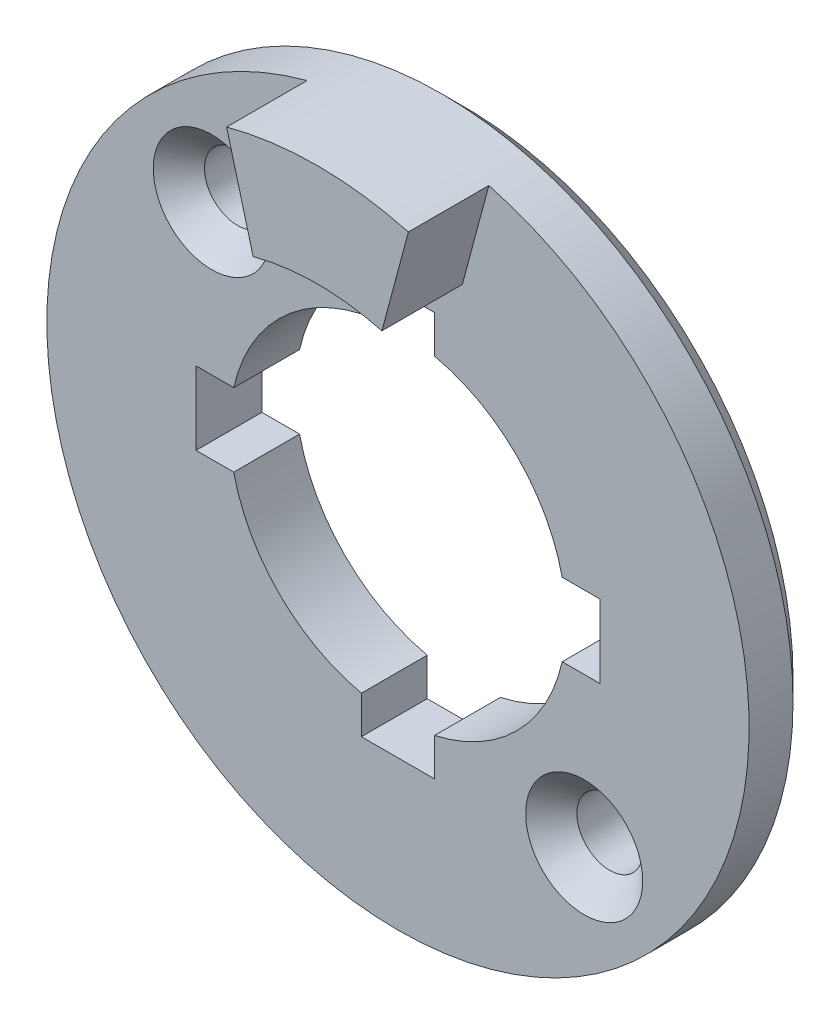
from build123d import *

# Parameters (mm, degrees)
ESQUISSE1_R                                      = 24
ESQUISSE1_R_2                                    = 11.5
EXTRUSION1_DEPTH                                 = 4.5
EXTRUSION2_DEPTH                                 = 5.5
CHANFREIN1_SIZE                                  = 1.5
ESQUISSE3_W                                      = 5
ESQUISSE3_H                                      = 2.57502784
ESQUISSE3_W_2                                    = 2.57502784
ESQUISSE3_H_2                                    = 5
ENL_V_MAT_EXTRU_1_DEPTH                          = 36.383612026
FRAISAGE_POUR_VIS_T_TE_FRAIS_E_6_PAN_D           = 4.5
FRAISAGE_POUR_VIS_T_TE_FRAIS_E_6_PAN_CSINK_D     = 8
FRAISAGE_POUR_VIS_T_TE_FRAIS_E_6_PAN_CSINK_ANGLE = 90
FRAISAGE_POUR_VIS_T_TE_FRAIS_E_6_2_D             = 4.5
FRAISAGE_POUR_VIS_T_TE_FRAIS_E_6_2_CSINK_D       = 8
FRAISAGE_POUR_VIS_T_TE_FRAIS_E_6_2_CSINK_ANGLE   = 90


with BuildPart() as part:
    # Esquisse1 → Extrusion1 (new body)
    with BuildSketch(Plane.XY):
        Circle(ESQUISSE1_R)
        Circle(ESQUISSE1_R_2, mode=Mode.SUBTRACT)
    extrude(amount=EXTRUSION1_DEPTH)

    # Esquisse2 → Extrusion2 (add)
    with BuildSketch(Plane.XY.offset(4.5)):
        with BuildLine():
            Line((4.399923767, 16.420739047), (6.211657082, 23.182219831))
            ThreePointArc((6.211657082, 23.182219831), (0, 24), (-6.211657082, 23.182219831))
            Line((-6.211657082, 23.182219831), (-4.399923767, 16.420739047))
            ThreePointArc((-4.399923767, 16.420739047), (0, 17), (4.399923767, 16.420739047))
        make_face()
    extrude(amount=EXTRUSION2_DEPTH)

    # Chanfrein1
    chanfrein1_edges = [part.edges().sort_by_distance(p)[0] for p in [
        (-24, 0, 0),
    ]]
    chamfer(chanfrein1_edges, length=CHANFREIN1_SIZE)

    # Esquisse3 → Enl_v. mat.-Extru.1 (cut, through all)
    with BuildSketch(Plane(origin=(0, 0, 0), x_dir=(-1, 0, 0), z_dir=(0, 0, -1))):
        with Locations((0, -12.51248608)):
            Rectangle(ESQUISSE3_W, ESQUISSE3_H)
        with Locations((0, 12.51248608)):
            Rectangle(ESQUISSE3_W, ESQUISSE3_H)
        with Locations((12.51248608, 0)):
            Rectangle(ESQUISSE3_W_2, ESQUISSE3_H_2)
        with Locations((-12.51248608, 0)):
            Rectangle(ESQUISSE3_W_2, ESQUISSE3_H_2)
    extrude(amount=-ENL_V_MAT_EXTRU_1_DEPTH, mode=Mode.SUBTRACT)

    # Fraisage pour vis _ t_te frais_e _ 6 pan (through all)
    with Locations(Plane(origin=(-12.727922, 12.727922, 4.5), x_dir=(1, 0, 0), z_dir=(0, 0, 1))):
        with Locations((0, 0), (25.455844, -25.455844)):
            CounterSinkHole(FRAISAGE_POUR_VIS_T_TE_FRAIS_E_6_PAN_D / 2, FRAISAGE_POUR_VIS_T_TE_FRAIS_E_6_PAN_CSINK_D / 2, counter_sink_angle=FRAISAGE_POUR_VIS_T_TE_FRAIS_E_6_PAN_CSINK_ANGLE)

    # Fraisage pour vis _ t_te frais_e _ 6 2 (through all)
    with Locations(Plane.XY):
        with Locations((0, 0)):
            CounterSinkHole(FRAISAGE_POUR_VIS_T_TE_FRAIS_E_6_2_D / 2, FRAISAGE_POUR_VIS_T_TE_FRAIS_E_6_2_CSINK_D / 2, counter_sink_angle=FRAISAGE_POUR_VIS_T_TE_FRAIS_E_6_2_CSINK_ANGLE)


solid = part.part
